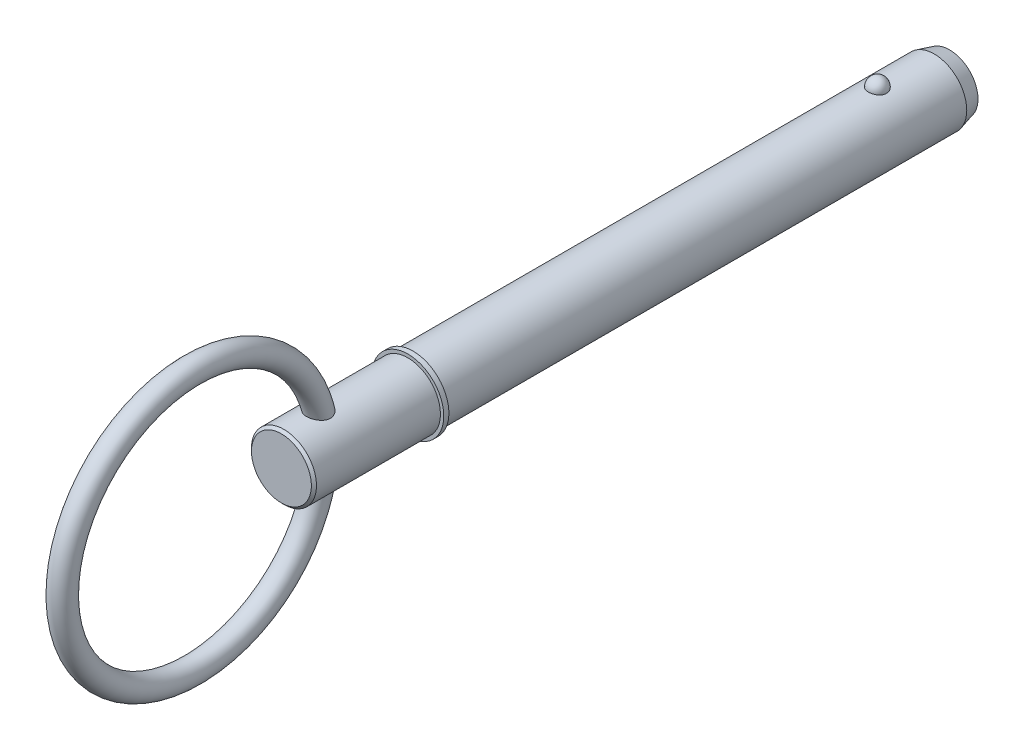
from build123d import *

# Parameters (mm, degrees)
SKETCH2_R           = 6.35
BOSS_EXTRUDE1_DEPTH = 88.9
BOSS_EXTRUDE2_START = 15.88
SKETCH3_R           = 6.35
BOSS_EXTRUDE2_DEPTH = 15.88
CHAMFER1_SIZE       = 3
CHAMFER1_SIZE2      = 0.803847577
SKETCH20_W          = 1
SKETCH20_H          = 7
SKETCH21_R          = 6.35
BOSS_EXTRUDE3_DEPTH = 25.7
CHAMFER2_SIZE       = 0.5
SKETCH24_R          = 2.25


with BuildPart() as part:
    # Sketch2 → Boss-Extrude1 (new body)
    with BuildSketch(Plane.XY):
        Circle(SKETCH2_R)
    extrude(amount=BOSS_EXTRUDE1_DEPTH)

    # Sketch3 → Boss-Extrude2 (add)
    with BuildSketch(Plane(origin=(0, 0, 0), x_dir=(-1, 0, 0), z_dir=(0, 0, -1)).offset(BOSS_EXTRUDE2_START)):
        Circle(SKETCH3_R)
    extrude(amount=-BOSS_EXTRUDE2_DEPTH)

    # Chamfer1
    chamfer1_edges = [part.edges().sort_by_distance(p)[0] for p in [
        (6.35, 0, -15.88),
    ]]
    chamfer1_side = [part.faces().sort_by_distance(p)[0] for p in [
        (6.35, 0, -7.94),
    ]]
    chamfer(chamfer1_edges, length=CHAMFER1_SIZE, length2=CHAMFER1_SIZE2, reference=chamfer1_side[0])

    # Sketch18 → Revolve1 (revolve)
    with BuildSketch(Plane(origin=(0, 0, 0), x_dir=(0, 0, -1), z_dir=(1, 0, 0))):
        with BuildLine():
            Line((1.78, 8.13), (1.78, 4.57))
            ThreePointArc((1.78, 4.57), (0, 6.35), (1.78, 8.13))
        make_face()
    revolve(axis=Axis((0, 8.13, -1.78), (0, -1, 0)))

    # Sketch20 → Revolve2 (revolve)
    with BuildSketch(Plane(origin=(0, 0, 0), x_dir=(0, 0, -1), z_dir=(1, 0, 0)), mode=Mode.PRIVATE) as revolve2_sk:
        with Locations((-89.4, 3.5)):
            Rectangle(SKETCH20_W, SKETCH20_H)
    revolve(revolve2_sk.sketch.rotate(Axis((0, 0, 33.728787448), (0, 0, 1)), 270), axis=Axis((0, 0, 33.728787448), (0, 0, 1)))

    # Sketch21 → Boss-Extrude3 (add)
    with BuildSketch(Plane(origin=(0, 0, 88.9), x_dir=(-1, 0, 0), z_dir=(0, 0, -1))):
        with Locations(Location((0, 0, 0), (0, 0, 180))):
            Circle(SKETCH21_R)
    extrude(amount=-BOSS_EXTRUDE3_DEPTH)

    # Chamfer2
    chamfer2_edges = [part.edges().sort_by_distance(p)[0] for p in [
        (-6.35, 0, 114.6),
    ]]
    chamfer(chamfer2_edges, length=CHAMFER2_SIZE)

    # Sweep1: sweep along a path in Sketch23
    with BuildLine(Plane(origin=(0, 0, 0), x_dir=(0, 0, -1), z_dir=(1, 0, 0))) as sweep1_path:
        CenterArc((-132, 0), 25.4, 0, 360)
    # Sketch24 → Sweep1 (sweep)
    with BuildSketch(Plane(origin=(0, 0, 0), x_dir=(1, 0, 0), z_dir=(0, 1, 0))):
        with Locations((0, -106.6)):
            Circle(SKETCH24_R)
    sweep(path=sweep1_path.line)


solid = part.part
